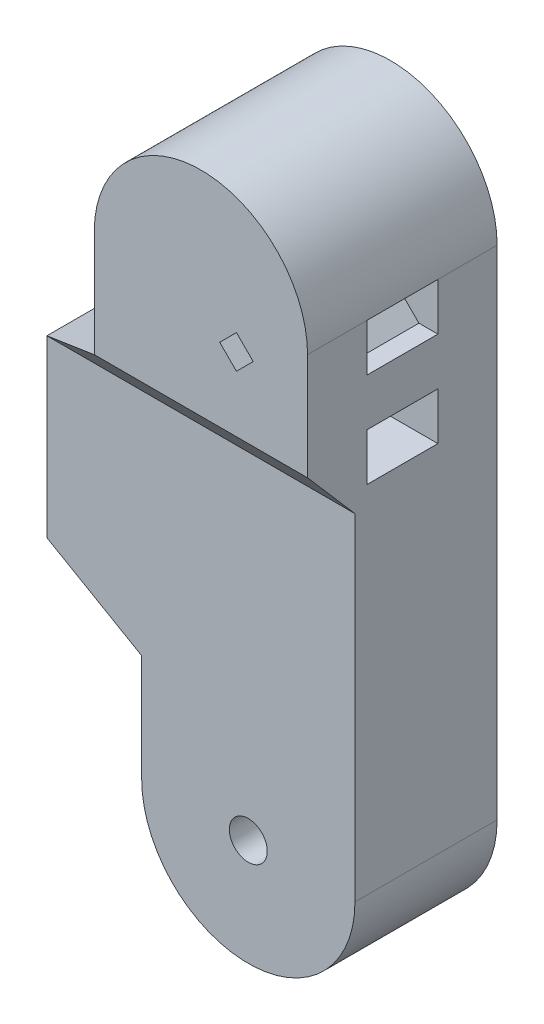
from build123d import *

# Parameters (mm, degrees)
EXTRUDE_1_DEPTH          = 20
CUT_EXTRUDE_1_DEPTH      = 102.242283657
CUT_EXTRUDE_2_DEPTH      = 7.5
CUT_EXTRUDE_3_DEPTH      = 96.032889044
CUT_EXTRUDE_3_DEPTH_BACK = 96.032889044
SKETCH_8_R               = 4
CUT_EXTRUDE_4_DEPTH      = 96.032889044


with BuildPart() as part:
    # Sketch 1 → Extrude 1 (new, symmetric)
    with BuildSketch(Plane.XY):
        with BuildLine():
            Line((22.5, -52.5), (22.5, 52.5))
            ThreePointArc((22.5, 52.5), (0, 75), (-22.5, 52.5))
            Line((-22.5, 52.5), (-22.5, -52.5))
            ThreePointArc((-22.5, -52.5), (0, -75), (22.5, -52.5))
        make_face()
        Polygon((-42.5, -18.452994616), (-22.5, -30), (-22.5, 30), (-42.5, 18.452994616), align=None)
    extrude(amount=EXTRUDE_1_DEPTH, both=True)

    # Sketch 2 → Cut-Extrude 1 (cut, through all)
    with BuildSketch(Plane.ZY.offset(42.5)):
        Polygon((10, -75), (10, 18.452994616), (20, 30), (20, 18.452994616), (20, -75), align=None)
    extrude(amount=-CUT_EXTRUDE_1_DEPTH, mode=Mode.SUBTRACT)

    # Sketch 3 → Cut-Extrude 2 (cut, symmetric)
    with BuildSketch(Plane.XY):
        Polygon((22.5, 52.5), (-9.5, 52.5), (-2.5, 45.5), (3.964466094, 45.5), (7.5, 49.035533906), (11.035533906, 45.5), (15.5, 45.5), (18.5, 42.5), (22.5, 42.5), align=None)
        Polygon((22.5, 32.5), (22.5, 22.5), (-9.5, 22.5), (-2.5, 29.5), (3.964466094, 29.5), (7.5, 25.964466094), (11.035533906, 29.5), (15.5, 29.5), (18.5, 32.5), align=None)
    extrude(amount=CUT_EXTRUDE_2_DEPTH, both=True, mode=Mode.SUBTRACT)

    # Sketch 4 → Cut-Extrude 3 (cut, two sides: drawn at the far end of the back side and taken through both)
    with BuildSketch(Plane.XY.offset(20).offset(-CUT_EXTRUDE_3_DEPTH_BACK)):
        Polygon((3.964466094, 45.5), (7.5, 41.964466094), (11.035533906, 45.5), (7.5, 49.035533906), align=None)
    extrude(amount=CUT_EXTRUDE_3_DEPTH + CUT_EXTRUDE_3_DEPTH_BACK, mode=Mode.SUBTRACT)

    # Sketch 8 → Cut-Extrude 4 (cut, through all)
    with BuildSketch(Plane(origin=(0, 0, -20), x_dir=(-1, 0, 0), z_dir=(0, 0, -1))):
        with Locations((0, -52.5)):
            Circle(SKETCH_8_R)
    extrude(amount=-CUT_EXTRUDE_4_DEPTH, mode=Mode.SUBTRACT)


solid = part.part
